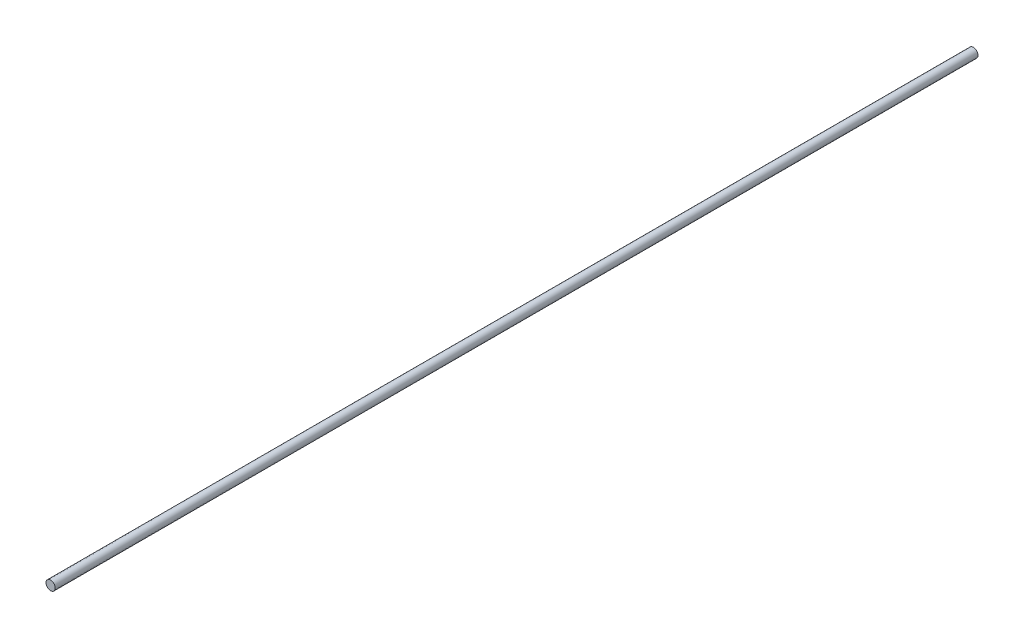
ISO-10303-21;
HEADER;
FILE_DESCRIPTION(('STEP AP214'),'2;1');
FILE_NAME('part.step','',(''),(''),'','','');
FILE_SCHEMA(('AUTOMOTIVE_DESIGN { 1 0 10303 214 1 1 1 1 }'));
ENDSEC;
DATA;
#1=APPLICATION_CONTEXT('core data for automotive mechanical design processes');
#2=APPLICATION_PROTOCOL_DEFINITION('international standard','automotive_design',2000,#1);
#3=PRODUCT_CONTEXT('',#1,'mechanical');
#4=PRODUCT('Part','Part','',(#3));
#5=PRODUCT_RELATED_PRODUCT_CATEGORY('part','',(#4));
#6=PRODUCT_DEFINITION_FORMATION('','',#4);
#7=PRODUCT_DEFINITION_CONTEXT('part definition',#1,'design');
#8=PRODUCT_DEFINITION('design','',#6,#7);
#9=PRODUCT_DEFINITION_SHAPE('','',#8);
#10=(LENGTH_UNIT() NAMED_UNIT(*) SI_UNIT(.MILLI.,.METRE.));
#11=(NAMED_UNIT(*) PLANE_ANGLE_UNIT() SI_UNIT($,.RADIAN.));
#12=(NAMED_UNIT(*) SI_UNIT($,.STERADIAN.) SOLID_ANGLE_UNIT());
#13=UNCERTAINTY_MEASURE_WITH_UNIT(LENGTH_MEASURE(1.E-05),#10,'distance_accuracy_value','');
#14=(GEOMETRIC_REPRESENTATION_CONTEXT(3) GLOBAL_UNCERTAINTY_ASSIGNED_CONTEXT((#13)) GLOBAL_UNIT_ASSIGNED_CONTEXT((#10,
#11,#12)) REPRESENTATION_CONTEXT('',''));
#15=CARTESIAN_POINT('',(0.,0.,0.));
#16=DIRECTION('',(0.,0.,1.));
#17=DIRECTION('',(1.,0.,0.));
#18=AXIS2_PLACEMENT_3D('',#15,#16,#17);
#19=CARTESIAN_POINT('',(0.,0.,50.));
#20=DIRECTION('',(0.,0.,-1.));
#21=DIRECTION('',(-1.,0.,0.));
#22=AXIS2_PLACEMENT_3D('',#19,#20,#21);
#23=CYLINDRICAL_SURFACE('',#22,0.25);
#24=CARTESIAN_POINT('',(0.,0.,50.));
#25=DIRECTION('',(0.,0.,1.));
#26=DIRECTION('',(1.,0.,0.));
#27=AXIS2_PLACEMENT_3D('',#24,#25,#26);
#28=CIRCLE('',#27,0.25);
#29=CARTESIAN_POINT('',(0.25,0.,50.));
#30=VERTEX_POINT('',#29);
#31=EDGE_CURVE('E10',#30,#30,#28,.T.);
#32=ORIENTED_EDGE('',*,*,#31,.F.);
#33=EDGE_LOOP('',(#32));
#34=FACE_BOUND('',#33,.T.);
#35=CARTESIAN_POINT('',(0.,0.,0.));
#36=DIRECTION('',(0.,0.,1.));
#37=DIRECTION('',(1.,0.,0.));
#38=AXIS2_PLACEMENT_3D('',#35,#36,#37);
#39=CIRCLE('',#38,0.25);
#40=CARTESIAN_POINT('',(0.25,0.,0.));
#41=VERTEX_POINT('',#40);
#42=EDGE_CURVE('E37',#41,#41,#39,.T.);
#43=ORIENTED_EDGE('',*,*,#42,.T.);
#44=EDGE_LOOP('',(#43));
#45=FACE_BOUND('',#44,.T.);
#46=ADVANCED_FACE('F34',(#34,#45),#23,.T.);
#47=CARTESIAN_POINT('',(0.,0.,50.));
#48=DIRECTION('',(0.,0.,1.));
#49=DIRECTION('',(1.,0.,0.));
#50=AXIS2_PLACEMENT_3D('',#47,#48,#49);
#51=PLANE('',#50);
#52=ORIENTED_EDGE('',*,*,#31,.T.);
#53=EDGE_LOOP('',(#52));
#54=FACE_BOUND('',#53,.T.);
#55=ADVANCED_FACE('F52',(#54),#51,.T.);
#56=CARTESIAN_POINT('',(0.,0.,0.));
#57=DIRECTION('',(0.,0.,1.));
#58=DIRECTION('',(1.,0.,0.));
#59=AXIS2_PLACEMENT_3D('',#56,#57,#58);
#60=PLANE('',#59);
#61=ORIENTED_EDGE('',*,*,#42,.F.);
#62=EDGE_LOOP('',(#61));
#63=FACE_BOUND('',#62,.T.);
#64=ADVANCED_FACE('F50',(#63),#60,.F.);
#65=CLOSED_SHELL('',(#46,#55,#64));
#66=MANIFOLD_SOLID_BREP('B2',#65);
#67=ADVANCED_BREP_SHAPE_REPRESENTATION('',(#18,#66),#14);
#68=SHAPE_DEFINITION_REPRESENTATION(#9,#67);
ENDSEC;
END-ISO-10303-21;
